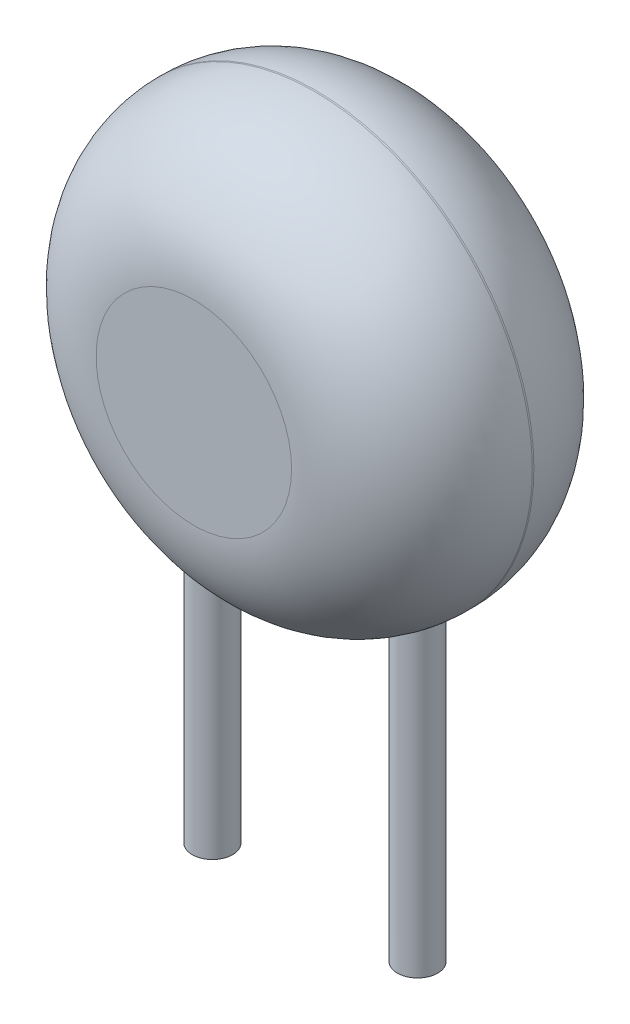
ISO-10303-21;
HEADER;
FILE_DESCRIPTION(('STEP AP214'),'2;1');
FILE_NAME('part.step','',(''),(''),'','','');
FILE_SCHEMA(('AUTOMOTIVE_DESIGN { 1 0 10303 214 1 1 1 1 }'));
ENDSEC;
DATA;
#1=APPLICATION_CONTEXT('core data for automotive mechanical design processes');
#2=APPLICATION_PROTOCOL_DEFINITION('international standard','automotive_design',2000,#1);
#3=PRODUCT_CONTEXT('',#1,'mechanical');
#4=PRODUCT('Part','Part','',(#3));
#5=PRODUCT_RELATED_PRODUCT_CATEGORY('part','',(#4));
#6=PRODUCT_DEFINITION_FORMATION('','',#4);
#7=PRODUCT_DEFINITION_CONTEXT('part definition',#1,'design');
#8=PRODUCT_DEFINITION('design','',#6,#7);
#9=PRODUCT_DEFINITION_SHAPE('','',#8);
#10=(LENGTH_UNIT() NAMED_UNIT(*) SI_UNIT(.MILLI.,.METRE.));
#11=(NAMED_UNIT(*) PLANE_ANGLE_UNIT() SI_UNIT($,.RADIAN.));
#12=(NAMED_UNIT(*) SI_UNIT($,.STERADIAN.) SOLID_ANGLE_UNIT());
#13=UNCERTAINTY_MEASURE_WITH_UNIT(LENGTH_MEASURE(1.E-05),#10,'distance_accuracy_value','');
#14=(GEOMETRIC_REPRESENTATION_CONTEXT(3) GLOBAL_UNCERTAINTY_ASSIGNED_CONTEXT((#13)) GLOBAL_UNIT_ASSIGNED_CONTEXT((#10,
#11,#12)) REPRESENTATION_CONTEXT('',''));
#15=CARTESIAN_POINT('',(0.,0.,0.));
#16=DIRECTION('',(0.,0.,1.));
#17=DIRECTION('',(1.,0.,0.));
#18=AXIS2_PLACEMENT_3D('',#15,#16,#17);
#19=CARTESIAN_POINT('',(0.,0.,3.));
#20=DIRECTION('',(0.,0.,-1.));
#21=DIRECTION('',(-1.,0.,0.));
#22=AXIS2_PLACEMENT_3D('',#19,#20,#21);
#23=CYLINDRICAL_SURFACE('',#22,2.7);
#24=CARTESIAN_POINT('',(0.,0.,1.51));
#25=DIRECTION('',(0.,0.,1.));
#26=DIRECTION('',(1.,0.,0.));
#27=AXIS2_PLACEMENT_3D('',#24,#25,#26);
#28=CIRCLE('',#27,2.7);
#29=CARTESIAN_POINT('',(1.02020008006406,-2.49983835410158,1.51));
#30=VERTEX_POINT('',#29);
#31=CARTESIAN_POINT('',(-1.02020008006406,-2.49983835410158,1.51));
#32=VERTEX_POINT('',#31);
#33=EDGE_CURVE('E88',#30,#32,#28,.F.);
#34=ORIENTED_EDGE('',*,*,#33,.T.);
#35=CARTESIAN_POINT('',(-1.27,-2.38266657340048,1.75));
#36=CARTESIAN_POINT('',(-1.25500944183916,-2.39065668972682,1.74999974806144));
#37=CARTESIAN_POINT('',(-1.23993911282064,-2.39850623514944,1.74865074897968));
#38=CARTESIAN_POINT('',(-1.21004988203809,-2.41372338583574,1.74318054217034));
#39=CARTESIAN_POINT('',(-1.19523102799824,-2.42109090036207,1.73905881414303));
#40=CARTESIAN_POINT('',(-1.16626288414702,-2.43517788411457,1.72799105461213));
#41=CARTESIAN_POINT('',(-1.15211663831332,-2.44189452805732,1.72103333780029));
#42=CARTESIAN_POINT('',(-1.12511800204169,-2.45445129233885,1.70435397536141));
#43=CARTESIAN_POINT('',(-1.112264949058,-2.46029186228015,1.69463375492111));
#44=CARTESIAN_POINT('',(-1.08947176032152,-2.47046432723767,1.67357794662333));
#45=CARTESIAN_POINT('',(-1.07937631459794,-2.47488267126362,1.66245251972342));
#46=CARTESIAN_POINT('',(-1.06122136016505,-2.48272174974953,1.63834273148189));
#47=CARTESIAN_POINT('',(-1.05316052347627,-2.486143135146,1.62535959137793));
#48=CARTESIAN_POINT('',(-1.04012618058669,-2.49162254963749,1.59924961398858));
#49=CARTESIAN_POINT('',(-1.03493243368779,-2.49377907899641,1.58625308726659));
#50=CARTESIAN_POINT('',(-1.02677195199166,-2.49715019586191,1.55946343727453));
#51=CARTESIAN_POINT('',(-1.02380430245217,-2.49836517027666,1.54567064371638));
#52=CARTESIAN_POINT('',(-1.02033795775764,-2.4997827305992,1.51856156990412));
#53=CARTESIAN_POINT('',(-1.01970361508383,-2.50004094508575,1.50526535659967));
#54=CARTESIAN_POINT('',(-1.02055185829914,-2.49969480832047,1.47875314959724));
#55=CARTESIAN_POINT('',(-1.02203410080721,-2.49909059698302,1.4655371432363));
#56=CARTESIAN_POINT('',(-1.02700868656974,-2.49705028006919,1.43979994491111));
#57=CARTESIAN_POINT('',(-1.03046531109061,-2.4956289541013,1.42727063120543));
#58=CARTESIAN_POINT('',(-1.03922462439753,-2.49199408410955,1.40299886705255));
#59=CARTESIAN_POINT('',(-1.04452738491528,-2.48978050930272,1.3912564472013));
#60=CARTESIAN_POINT('',(-1.05690931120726,-2.48454998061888,1.3686137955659));
#61=CARTESIAN_POINT('',(-1.06402335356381,-2.48151717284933,1.35773635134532));
#62=CARTESIAN_POINT('',(-1.07971138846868,-2.47473154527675,1.33734752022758));
#63=CARTESIAN_POINT('',(-1.08828566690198,-2.47097858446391,1.3278364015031));
#64=CARTESIAN_POINT('',(-1.10712682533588,-2.46259661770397,1.30986544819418));
#65=CARTESIAN_POINT('',(-1.11746162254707,-2.45793030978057,1.30149437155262));
#66=CARTESIAN_POINT('',(-1.13911021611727,-2.44797261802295,1.2865972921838));
#67=CARTESIAN_POINT('',(-1.15042433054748,-2.44268103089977,1.28007189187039));
#68=CARTESIAN_POINT('',(-1.17470219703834,-2.43110474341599,1.26845210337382));
#69=CARTESIAN_POINT('',(-1.18772445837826,-2.42477387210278,1.26352617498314));
#70=CARTESIAN_POINT('',(-1.21417733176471,-2.41163675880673,1.25592321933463));
#71=CARTESIAN_POINT('',(-1.2276081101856,-2.40483032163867,1.25324712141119));
#72=CARTESIAN_POINT('',(-1.25586994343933,-2.3902024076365,1.2499561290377));
#73=CARTESIAN_POINT('',(-1.27070975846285,-2.3823466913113,1.24956783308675));
#74=CARTESIAN_POINT('',(-1.30011748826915,-2.36642654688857,1.25138339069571));
#75=CARTESIAN_POINT('',(-1.3146852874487,-2.35836203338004,1.25358832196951));
#76=CARTESIAN_POINT('',(-1.34429169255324,-2.34162125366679,1.26077220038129));
#77=CARTESIAN_POINT('',(-1.35928284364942,-2.33294475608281,1.26594796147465));
#78=CARTESIAN_POINT('',(-1.38816748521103,-2.31587409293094,1.27911867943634));
#79=CARTESIAN_POINT('',(-1.40206023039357,-2.30748012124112,1.28711553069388));
#80=CARTESIAN_POINT('',(-1.42829479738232,-2.29133390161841,1.30582924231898));
#81=CARTESIAN_POINT('',(-1.44063786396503,-2.28358114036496,1.3165438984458));
#82=CARTESIAN_POINT('',(-1.46325974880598,-2.26915195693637,1.34055884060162));
#83=CARTESIAN_POINT('',(-1.47354267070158,-2.26247340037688,1.35385388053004));
#84=CARTESIAN_POINT('',(-1.48891293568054,-2.25237604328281,1.37865001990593));
#85=CARTESIAN_POINT('',(-1.49464718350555,-2.24856952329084,1.38959498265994));
#86=CARTESIAN_POINT('',(-1.50450852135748,-2.24198334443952,1.41247563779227));
#87=CARTESIAN_POINT('',(-1.50863690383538,-2.23920285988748,1.42441052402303));
#88=CARTESIAN_POINT('',(-1.51508478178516,-2.23484532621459,1.44904567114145));
#89=CARTESIAN_POINT('',(-1.5173945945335,-2.23327471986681,1.46174964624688));
#90=CARTESIAN_POINT('',(-1.5200186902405,-2.23148961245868,1.48745641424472));
#91=CARTESIAN_POINT('',(-1.52033366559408,-2.23127464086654,1.50045910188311));
#92=CARTESIAN_POINT('',(-1.51901189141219,-2.23217454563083,1.52514005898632));
#93=CARTESIAN_POINT('',(-1.51754767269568,-2.23317186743,1.53683251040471));
#94=CARTESIAN_POINT('',(-1.51303355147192,-2.23623272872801,1.55975973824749));
#95=CARTESIAN_POINT('',(-1.50998356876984,-2.23829632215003,1.5709944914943));
#96=CARTESIAN_POINT('',(-1.50238790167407,-2.24340180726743,1.59291166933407));
#97=CARTESIAN_POINT('',(-1.4978195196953,-2.24645852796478,1.60358267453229));
#98=CARTESIAN_POINT('',(-1.48739059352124,-2.25337708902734,1.62398699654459));
#99=CARTESIAN_POINT('',(-1.48152960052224,-2.25723920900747,1.63371998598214));
#100=CARTESIAN_POINT('',(-1.4679088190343,-2.26612390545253,1.65326802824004));
#101=CARTESIAN_POINT('',(-1.46000357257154,-2.27123105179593,1.66294293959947));
#102=CARTESIAN_POINT('',(-1.44304935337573,-2.28204070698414,1.68084852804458));
#103=CARTESIAN_POINT('',(-1.43399965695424,-2.28774359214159,1.68907828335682));
#104=CARTESIAN_POINT('',(-1.41342063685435,-2.30052415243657,1.70525233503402));
#105=CARTESIAN_POINT('',(-1.40172760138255,-2.30767437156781,1.71293128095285));
#106=CARTESIAN_POINT('',(-1.37738599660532,-2.32228541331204,1.72618679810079));
#107=CARTESIAN_POINT('',(-1.36473712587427,-2.32974633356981,1.73176270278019));
#108=CARTESIAN_POINT('',(-1.33863624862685,-2.34484160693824,1.74079327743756));
#109=CARTESIAN_POINT('',(-1.3251780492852,-2.35247691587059,1.74422844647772));
#110=CARTESIAN_POINT('',(-1.2978362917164,-2.3676709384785,1.74883201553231));
#111=CARTESIAN_POINT('',(-1.28395269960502,-2.37522964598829,1.75000023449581));
#112=CARTESIAN_POINT('',(-1.27,-2.38266657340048,1.75));
#113=B_SPLINE_CURVE_WITH_KNOTS('',3,(#35,#36,#37,#38,#39,#40,#41,#42,#43,#44,#45,#46,#47,#48,
#49,#50,#51,#52,#53,#54,#55,#56,#57,#58,#59,#60,#61,#62,#63,#64,#65,#66,#67,#68,#69,#70,#71,#72,
#73,#74,#75,#76,#77,#78,#79,#80,#81,#82,#83,#84,#85,#86,#87,#88,#89,#90,#91,#92,#93,#94,#95,#96,
#97,#98,#99,#100,#101,#102,#103,#104,#105,#106,#107,#108,#109,#110,#111,#112),.UNSPECIFIED.,.T.,
.F.,(4,2,2,2,2,2,2,2,2,2,2,2,2,2,2,2,2,2,2,2,2,2,2,2,2,2,2,2,2,2,2,2,2,2,2,2,2,2,4),(0.,
0.0509100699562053,0.101829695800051,0.152961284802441,0.204066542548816,0.250786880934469,
0.29747664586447,0.339740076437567,0.381986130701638,0.421733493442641,0.461474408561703,
0.500518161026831,0.539563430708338,0.579426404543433,0.619297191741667,0.661401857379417,
0.703520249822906,0.749213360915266,0.794925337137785,0.845097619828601,0.895290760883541,
0.949272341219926,1.0032902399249,1.05726446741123,1.11113008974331,1.14976081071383,
1.18836037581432,1.22716409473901,1.26595434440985,1.30126520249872,1.33657784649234,
1.37244406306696,1.40832275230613,1.44866058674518,1.48902405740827,1.5359690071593,
1.58292882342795,1.63031039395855,1.67769574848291),.UNSPECIFIED.);
#114=CARTESIAN_POINT('',(-1.02020008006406,-2.49983835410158,1.49));
#115=VERTEX_POINT('',#114);
#116=EDGE_CURVE('E54',#32,#115,#113,.T.);
#117=ORIENTED_EDGE('',*,*,#116,.T.);
#118=CARTESIAN_POINT('',(0.,0.,1.49));
#119=DIRECTION('',(0.,0.,1.));
#120=DIRECTION('',(1.,0.,0.));
#121=AXIS2_PLACEMENT_3D('',#118,#119,#120);
#122=CIRCLE('',#121,2.7);
#123=CARTESIAN_POINT('',(1.02020008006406,-2.49983835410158,1.49));
#124=VERTEX_POINT('',#123);
#125=EDGE_CURVE('E162',#115,#124,#122,.T.);
#126=ORIENTED_EDGE('',*,*,#125,.T.);
#127=CARTESIAN_POINT('',(1.27,-2.38266657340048,1.75));
#128=CARTESIAN_POINT('',(1.28883515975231,-2.37262653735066,1.74999924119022));
#129=CARTESIAN_POINT('',(1.30757625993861,-2.36234678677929,1.74786738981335));
#130=CARTESIAN_POINT('',(1.34413607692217,-2.34173885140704,1.73949321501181));
#131=CARTESIAN_POINT('',(1.36195238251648,-2.33141060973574,1.73324067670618));
#132=CARTESIAN_POINT('',(1.39342450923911,-2.31271540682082,1.71800271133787));
#133=CARTESIAN_POINT('',(1.40730572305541,-2.30428451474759,1.70955916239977));
#134=CARTESIAN_POINT('',(1.43340490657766,-2.28814002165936,1.68990688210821));
#135=CARTESIAN_POINT('',(1.44562663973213,-2.28042481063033,1.67870457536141));
#136=CARTESIAN_POINT('',(1.46531577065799,-2.26780815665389,1.65658123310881));
#137=CARTESIAN_POINT('',(1.4732294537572,-2.26266825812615,1.6461919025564));
#138=CARTESIAN_POINT('',(1.48748188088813,-2.25332425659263,1.62399687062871));
#139=CARTESIAN_POINT('',(1.49382125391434,-2.24911977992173,1.61219173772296));
#140=CARTESIAN_POINT('',(1.50465483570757,-2.24188691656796,1.58730684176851));
#141=CARTESIAN_POINT('',(1.50913517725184,-2.23886737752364,1.57421836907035));
#142=CARTESIAN_POINT('',(1.51588863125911,-2.23430051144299,1.54723905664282));
#143=CARTESIAN_POINT('',(1.51816384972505,-2.23275177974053,1.53334899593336));
#144=CARTESIAN_POINT('',(1.52019927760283,-2.23136622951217,1.50711583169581));
#145=CARTESIAN_POINT('',(1.52024618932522,-2.23133425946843,1.49480445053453));
#146=CARTESIAN_POINT('',(1.51853939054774,-2.23249618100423,1.47036818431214));
#147=CARTESIAN_POINT('',(1.51678605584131,-2.23368981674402,1.45824326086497));
#148=CARTESIAN_POINT('',(1.51170313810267,-2.23713261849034,1.43508622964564));
#149=CARTESIAN_POINT('',(1.50844949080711,-2.23933089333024,1.42402950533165));
#150=CARTESIAN_POINT('',(1.50055220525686,-2.24463039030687,1.40265745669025));
#151=CARTESIAN_POINT('',(1.49590825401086,-2.24773181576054,1.39234229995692));
#152=CARTESIAN_POINT('',(1.48496045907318,-2.25498091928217,1.37178551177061));
#153=CARTESIAN_POINT('',(1.47854884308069,-2.2591952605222,1.36162514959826));
#154=CARTESIAN_POINT('',(1.46452480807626,-2.26831150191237,1.34251739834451));
#155=CARTESIAN_POINT('',(1.45691177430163,-2.27321375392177,1.333570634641));
#156=CARTESIAN_POINT('',(1.43942665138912,-2.28433228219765,1.31567849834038));
#157=CARTESIAN_POINT('',(1.42938737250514,-2.29063433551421,1.30694988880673));
#158=CARTESIAN_POINT('',(1.40825413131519,-2.30368723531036,1.29129205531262));
#159=CARTESIAN_POINT('',(1.39715953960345,-2.31043834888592,1.28436391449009));
#160=CARTESIAN_POINT('',(1.37241864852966,-2.325232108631,1.27145408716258));
#161=CARTESIAN_POINT('',(1.3586397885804,-2.33331605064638,1.26577244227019));
#162=CARTESIAN_POINT('',(1.33033703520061,-2.34956806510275,1.25693738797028));
#163=CARTESIAN_POINT('',(1.31581276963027,-2.35773617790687,1.25378525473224));
#164=CARTESIAN_POINT('',(1.2852353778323,-2.37455186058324,1.24995435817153));
#165=CARTESIAN_POINT('',(1.26914989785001,-2.38318874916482,1.24948154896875));
#166=CARTESIAN_POINT('',(1.23696807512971,-2.40004997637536,1.25166776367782));
#167=CARTESIAN_POINT('',(1.2208717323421,-2.40827431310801,1.25432680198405));
#168=CARTESIAN_POINT('',(1.18962121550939,-2.42386020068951,1.26273623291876));
#169=CARTESIAN_POINT('',(1.17445339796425,-2.43123874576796,1.2684035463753));
#170=CARTESIAN_POINT('',(1.14519981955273,-2.44515428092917,1.28276764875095));
#171=CARTESIAN_POINT('',(1.13111337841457,-2.45169180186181,1.29146251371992));
#172=CARTESIAN_POINT('',(1.10591234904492,-2.46315484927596,1.31078252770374));
#173=CARTESIAN_POINT('',(1.09464290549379,-2.4681741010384,1.32114974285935));
#174=CARTESIAN_POINT('',(1.07402758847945,-2.47721448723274,1.34401537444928));
#175=CARTESIAN_POINT('',(1.06468032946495,-2.48123634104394,1.35651224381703));
#176=CARTESIAN_POINT('',(1.04920588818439,-2.4878164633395,1.38189741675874));
#177=CARTESIAN_POINT('',(1.04284849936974,-2.49048168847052,1.39461798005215));
#178=CARTESIAN_POINT('',(1.03235154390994,-2.494851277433,1.42109691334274));
#179=CARTESIAN_POINT('',(1.02821091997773,-2.49655609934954,1.43485478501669));
#180=CARTESIAN_POINT('',(1.02254580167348,-2.4988815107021,1.46198526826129));
#181=CARTESIAN_POINT('',(1.02086021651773,-2.49956891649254,1.475318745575));
#182=CARTESIAN_POINT('',(1.01965002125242,-2.50006286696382,1.50209857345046));
#183=CARTESIAN_POINT('',(1.02012494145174,-2.4998696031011,1.51554489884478));
#184=CARTESIAN_POINT('',(1.02317207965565,-2.49862389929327,1.54178118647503));
#185=CARTESIAN_POINT('',(1.02568662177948,-2.49759508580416,1.55457904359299));
#186=CARTESIAN_POINT('',(1.0326383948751,-2.49472883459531,1.57954481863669));
#187=CARTESIAN_POINT('',(1.03707562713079,-2.4928913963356,1.59171273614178));
#188=CARTESIAN_POINT('',(1.04776614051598,-2.48841714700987,1.61524380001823));
#189=CARTESIAN_POINT('',(1.05404062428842,-2.48577098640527,1.62659550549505));
#190=CARTESIAN_POINT('',(1.06815127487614,-2.47974022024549,1.64806135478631));
#191=CARTESIAN_POINT('',(1.07598762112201,-2.47635552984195,1.65817535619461));
#192=CARTESIAN_POINT('',(1.09336280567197,-2.46873485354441,1.67741257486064));
#193=CARTESIAN_POINT('',(1.10296517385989,-2.46446587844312,1.68646520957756));
#194=CARTESIAN_POINT('',(1.12327506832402,-2.45527541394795,1.70283520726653));
#195=CARTESIAN_POINT('',(1.13398319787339,-2.45035356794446,1.71015161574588));
#196=CARTESIAN_POINT('',(1.15707015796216,-2.43954166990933,1.72346873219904));
#197=CARTESIAN_POINT('',(1.16951413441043,-2.43360577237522,1.72931886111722));
#198=CARTESIAN_POINT('',(1.19494641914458,-2.42121928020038,1.73885408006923));
#199=CARTESIAN_POINT('',(1.20793430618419,-2.41476908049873,1.74254081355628));
#200=CARTESIAN_POINT('',(1.22914948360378,-2.40401222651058,1.74677901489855));
#201=CARTESIAN_POINT('',(1.23731086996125,-2.39982215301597,1.74798948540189));
#202=CARTESIAN_POINT('',(1.25365405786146,-2.39132528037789,1.74960026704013));
#203=CARTESIAN_POINT('',(1.26183586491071,-2.3870184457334,1.75000032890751));
#204=CARTESIAN_POINT('',(1.27,-2.38266657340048,1.75));
#205=B_SPLINE_CURVE_WITH_KNOTS('',3,(#127,#128,#129,#130,#131,#132,#133,#134,#135,#136,#137,
#138,#139,#140,#141,#142,#143,#144,#145,#146,#147,#148,#149,#150,#151,#152,#153,#154,#155,#156,
#157,#158,#159,#160,#161,#162,#163,#164,#165,#166,#167,#168,#169,#170,#171,#172,#173,#174,#175,
#176,#177,#178,#179,#180,#181,#182,#183,#184,#185,#186,#187,#188,#189,#190,#191,#192,#193,#194,
#195,#196,#197,#198,#199,#200,#201,#202,#203,#204),.UNSPECIFIED.,.T.,.F.,(4,2,2,2,2,2,2,2,2,2,2,
2,2,2,2,2,2,2,2,2,2,2,2,2,2,2,2,2,2,2,2,2,2,2,2,2,2,2,4),(0.,0.06398654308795,0.12813230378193,
0.182778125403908,0.237297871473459,0.279235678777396,0.321156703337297,0.363385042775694,
0.405573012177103,0.442315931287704,0.479051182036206,0.514102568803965,0.5491618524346,
0.587210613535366,0.62527890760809,0.669269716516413,0.713286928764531,0.763938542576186,
0.814615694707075,0.869140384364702,0.923665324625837,0.976757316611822,1.02981563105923,
1.07789153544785,1.1259326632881,1.16910970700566,1.21226613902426,1.25243862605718,
1.29260238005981,1.33166842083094,1.37073448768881,1.4102704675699,1.44981099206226,
1.49124385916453,1.53269945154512,1.57744640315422,1.62215931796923,1.64988587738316,
1.67762096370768),.UNSPECIFIED.);
#206=EDGE_CURVE('E133',#124,#30,#205,.T.);
#207=ORIENTED_EDGE('',*,*,#206,.T.);
#208=EDGE_LOOP('',(#34,#117,#126,#207));
#209=FACE_BOUND('',#208,.T.);
#210=ADVANCED_FACE('F33',(#209),#23,.T.);
#211=CARTESIAN_POINT('',(1.51979991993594,-2.23163800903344,1.49));
#212=VERTEX_POINT('',#211);
#213=CARTESIAN_POINT('',(-1.51979991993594,-2.23163800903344,1.49));
#214=VERTEX_POINT('',#213);
#215=EDGE_CURVE('E93',#212,#214,#122,.T.);
#216=ORIENTED_EDGE('',*,*,#215,.T.);
#217=CARTESIAN_POINT('',(-1.51979991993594,-2.23163800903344,1.51));
#218=VERTEX_POINT('',#217);
#219=EDGE_CURVE('E92',#214,#218,#113,.T.);
#220=ORIENTED_EDGE('',*,*,#219,.T.);
#221=CARTESIAN_POINT('',(1.51979991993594,-2.23163800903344,1.51));
#222=VERTEX_POINT('',#221);
#223=EDGE_CURVE('E81',#218,#222,#28,.F.);
#224=ORIENTED_EDGE('',*,*,#223,.T.);
#225=EDGE_CURVE('E137',#222,#212,#205,.T.);
#226=ORIENTED_EDGE('',*,*,#225,.T.);
#227=EDGE_LOOP('',(#216,#220,#224,#226));
#228=FACE_BOUND('',#227,.T.);
#229=ADVANCED_FACE('F35',(#228),#23,.T.);
#230=CARTESIAN_POINT('',(0.,0.,3.));
#231=DIRECTION('',(0.,0.,1.));
#232=DIRECTION('',(1.,0.,0.));
#233=AXIS2_PLACEMENT_3D('',#230,#231,#232);
#234=PLANE('',#233);
#235=CARTESIAN_POINT('',(0.,0.,3.));
#236=DIRECTION('',(0.,0.,1.));
#237=DIRECTION('',(1.,0.,0.));
#238=AXIS2_PLACEMENT_3D('',#235,#236,#237);
#239=CIRCLE('',#238,1.21);
#240=CARTESIAN_POINT('',(1.21,0.,3.));
#241=VERTEX_POINT('',#240);
#242=EDGE_CURVE('E167',#241,#241,#239,.T.);
#243=ORIENTED_EDGE('',*,*,#242,.T.);
#244=EDGE_LOOP('',(#243));
#245=FACE_BOUND('',#244,.T.);
#246=ADVANCED_FACE('F150',(#245),#234,.T.);
#247=CARTESIAN_POINT('',(0.,0.,0.));
#248=DIRECTION('',(0.,0.,1.));
#249=DIRECTION('',(1.,0.,0.));
#250=AXIS2_PLACEMENT_3D('',#247,#248,#249);
#251=PLANE('',#250);
#252=CARTESIAN_POINT('',(0.,0.,0.));
#253=DIRECTION('',(0.,0.,1.));
#254=DIRECTION('',(1.,0.,0.));
#255=AXIS2_PLACEMENT_3D('',#252,#253,#254);
#256=CIRCLE('',#255,1.21);
#257=CARTESIAN_POINT('',(1.21,0.,0.));
#258=VERTEX_POINT('',#257);
#259=EDGE_CURVE('E164',#258,#258,#256,.F.);
#260=ORIENTED_EDGE('',*,*,#259,.T.);
#261=EDGE_LOOP('',(#260));
#262=FACE_BOUND('',#261,.T.);
#263=ADVANCED_FACE('F147',(#262),#251,.F.);
#264=CARTESIAN_POINT('',(0.,0.,1.49));
#265=DIRECTION('',(0.,0.,1.));
#266=DIRECTION('',(1.,0.,0.));
#267=AXIS2_PLACEMENT_3D('',#264,#265,#266);
#268=DEGENERATE_TOROIDAL_SURFACE('',#267,1.21,1.49,.T.);
#269=CARTESIAN_POINT('',(-1.5198078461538,-2.23163259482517,1.4902));
#270=CARTESIAN_POINT('',(-1.51930724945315,-2.23198023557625,1.47704435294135));
#271=CARTESIAN_POINT('',(-1.51773879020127,-2.23283512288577,1.46395739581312));
#272=CARTESIAN_POINT('',(-1.51261921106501,-2.23549612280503,1.43832337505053));
#273=CARTESIAN_POINT('',(-1.50907505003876,-2.23729889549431,1.42577458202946));
#274=CARTESIAN_POINT('',(-1.50015446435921,-2.24179421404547,1.40153013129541));
#275=CARTESIAN_POINT('',(-1.49477922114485,-2.24448618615,1.38983392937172));
#276=CARTESIAN_POINT('',(-1.48241682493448,-2.25067225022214,1.36755605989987));
#277=CARTESIAN_POINT('',(-1.4754287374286,-2.25416680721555,1.35697504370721));
#278=CARTESIAN_POINT('',(-1.45976137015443,-2.26202229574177,1.33671616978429));
#279=CARTESIAN_POINT('',(-1.45102234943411,-2.26641398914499,1.32709661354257));
#280=CARTESIAN_POINT('',(-1.43235712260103,-2.27583904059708,1.30946076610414));
#281=CARTESIAN_POINT('',(-1.42243051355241,-2.28087261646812,1.3014450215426));
#282=CARTESIAN_POINT('',(-1.40066015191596,-2.29197795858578,1.28641279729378));
#283=CARTESIAN_POINT('',(-1.3887238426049,-2.29810309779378,1.27956993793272));
#284=CARTESIAN_POINT('',(-1.36410815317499,-2.31082736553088,1.2679894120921));
#285=CARTESIAN_POINT('',(-1.35142846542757,-2.31742669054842,1.26325262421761));
#286=CARTESIAN_POINT('',(-1.32428298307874,-2.33166252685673,1.2555152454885));
#287=CARTESIAN_POINT('',(-1.3097692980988,-2.33933524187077,1.25274873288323));
#288=CARTESIAN_POINT('',(-1.28059066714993,-2.35488883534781,1.24979385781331));
#289=CARTESIAN_POINT('',(-1.26592566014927,-2.36276979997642,1.24960657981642));
#290=CARTESIAN_POINT('',(-1.23568301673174,-2.37914959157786,1.25186826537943));
#291=CARTESIAN_POINT('',(-1.22012080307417,-2.38764982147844,1.25451882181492));
#292=CARTESIAN_POINT('',(-1.18964628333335,-2.40442083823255,1.26273964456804));
#293=CARTESIAN_POINT('',(-1.17473423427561,-2.41269153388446,1.26831105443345));
#294=CARTESIAN_POINT('',(-1.14596044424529,-2.42875117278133,1.28235034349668));
#295=CARTESIAN_POINT('',(-1.1321028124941,-2.43653821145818,1.29082890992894));
#296=CARTESIAN_POINT('',(-1.10601795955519,-2.45126543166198,1.31058743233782));
#297=CARTESIAN_POINT('',(-1.09378992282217,-2.45820603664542,1.32186597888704));
#298=CARTESIAN_POINT('',(-1.07256940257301,-2.47028117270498,1.34587663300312));
#299=CARTESIAN_POINT('',(-1.06338379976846,-2.47552255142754,1.35838326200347));
#300=CARTESIAN_POINT('',(-1.0473533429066,-2.48466511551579,1.38523147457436));
#301=CARTESIAN_POINT('',(-1.04050272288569,-2.48856960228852,1.39956841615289));
#302=CARTESIAN_POINT('',(-1.03070217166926,-2.49412002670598,1.4265295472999));
#303=CARTESIAN_POINT('',(-1.02724203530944,-2.4960639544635,1.4389081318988));
#304=CARTESIAN_POINT('',(-1.02222964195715,-2.49882945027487,1.46423119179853));
#305=CARTESIAN_POINT('',(-1.02068732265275,-2.49964517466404,1.47717825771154));
#306=CARTESIAN_POINT('',(-1.0201921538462,-2.49984157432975,1.4902));
#307=B_SPLINE_CURVE_WITH_KNOTS('',3,(#269,#270,#271,#272,#273,#274,#275,#276,#277,#278,#279,
#280,#281,#282,#283,#284,#285,#286,#287,#288,#289,#290,#291,#292,#293,#294,#295,#296,#297,#298,
#299,#300,#301,#302,#303,#304,#305,#306),.UNSPECIFIED.,.F.,.F.,(4,2,2,2,2,2,2,2,2,2,2,2,2,2,2,2,
2,2,4),(0.,0.0394373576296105,0.0787366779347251,0.118010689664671,0.157307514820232,
0.198291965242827,0.239290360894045,0.284285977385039,0.329300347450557,0.379033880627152,
0.428788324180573,0.48232703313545,0.535886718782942,0.589645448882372,0.643377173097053,
0.692222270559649,0.740945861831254,0.779749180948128,0.818752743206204),.UNSPECIFIED.);
#308=EDGE_CURVE('E61',#214,#115,#307,.T.);
#309=ORIENTED_EDGE('',*,*,#308,.F.);
#310=ORIENTED_EDGE('',*,*,#215,.F.);
#311=CARTESIAN_POINT('',(1.0201921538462,-2.49984157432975,1.4902));
#312=CARTESIAN_POINT('',(1.02067722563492,-2.49964933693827,1.47741629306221));
#313=CARTESIAN_POINT('',(1.02217399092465,-2.49885884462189,1.46469929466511));
#314=CARTESIAN_POINT('',(1.0270299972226,-2.49618213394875,1.43980567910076));
#315=CARTESIAN_POINT('',(1.03038038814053,-2.49430112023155,1.42762678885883));
#316=CARTESIAN_POINT('',(1.03878519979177,-2.48954334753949,1.40410272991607));
#317=CARTESIAN_POINT('',(1.04383759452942,-2.48666777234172,1.39275658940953));
#318=CARTESIAN_POINT('',(1.05543073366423,-2.48005944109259,1.37111718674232));
#319=CARTESIAN_POINT('',(1.0619729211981,-2.47632585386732,1.36082495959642));
#320=CARTESIAN_POINT('',(1.07674684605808,-2.46790386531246,1.34088874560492));
#321=CARTESIAN_POINT('',(1.08505689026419,-2.46317134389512,1.33132172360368));
#322=CARTESIAN_POINT('',(1.10281952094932,-2.45308472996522,1.31370084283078));
#323=CARTESIAN_POINT('',(1.11227250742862,-2.44773041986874,1.30564751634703));
#324=CARTESIAN_POINT('',(1.13340220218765,-2.43581033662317,1.29015537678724));
#325=CARTESIAN_POINT('',(1.1452072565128,-2.42917829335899,1.28294256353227));
#326=CARTESIAN_POINT('',(1.16965433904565,-2.41552150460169,1.2706129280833));
#327=CARTESIAN_POINT('',(1.18229680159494,-2.40849655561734,1.26549720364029));
#328=CARTESIAN_POINT('',(1.20967494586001,-2.39338170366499,1.25691488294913));
#329=CARTESIAN_POINT('',(1.22448051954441,-2.38526466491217,1.25371751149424));
#330=CARTESIAN_POINT('',(1.25440609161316,-2.36898843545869,1.25003138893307));
#331=CARTESIAN_POINT('',(1.26952621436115,-2.36082922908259,1.24954373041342));
#332=CARTESIAN_POINT('',(1.3005475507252,-2.34422870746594,1.25136081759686));
#333=CARTESIAN_POINT('',(1.31644517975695,-2.33579711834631,1.25382318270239));
#334=CARTESIAN_POINT('',(1.34769019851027,-2.31937120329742,1.26183147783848));
#335=CARTESIAN_POINT('',(1.36303754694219,-2.31137691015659,1.26737763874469));
#336=CARTESIAN_POINT('',(1.39215438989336,-2.29633391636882,1.28129906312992));
#337=CARTESIAN_POINT('',(1.40595905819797,-2.28926285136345,1.28957594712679));
#338=CARTESIAN_POINT('',(1.4319831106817,-2.27602059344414,1.30888891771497));
#339=CARTESIAN_POINT('',(1.44420373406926,-2.26984869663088,1.31992282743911));
#340=CARTESIAN_POINT('',(1.46534741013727,-2.25921519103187,1.34327654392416));
#341=CARTESIAN_POINT('',(1.47447771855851,-2.25464443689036,1.35535862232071));
#342=CARTESIAN_POINT('',(1.4905149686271,-2.24661993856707,1.381238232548));
#343=CARTESIAN_POINT('',(1.49742500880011,-2.24316463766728,1.39503333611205));
#344=CARTESIAN_POINT('',(1.50796939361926,-2.23785918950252,1.42217839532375));
#345=CARTESIAN_POINT('',(1.51189454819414,-2.23586750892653,1.43538795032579));
#346=CARTESIAN_POINT('',(1.51755418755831,-2.23293574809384,1.46243593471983));
#347=CARTESIAN_POINT('',(1.51927952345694,-2.23200006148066,1.47627674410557));
#348=CARTESIAN_POINT('',(1.5198078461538,-2.23163259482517,1.4902));
#349=B_SPLINE_CURVE_WITH_KNOTS('',3,(#311,#312,#313,#314,#315,#316,#317,#318,#319,#320,#321,
#322,#323,#324,#325,#326,#327,#328,#329,#330,#331,#332,#333,#334,#335,#336,#337,#338,#339,#340,
#341,#342,#343,#344,#345,#346,#347,#348),.UNSPECIFIED.,.F.,.F.,(4,2,2,2,2,2,2,2,2,2,2,2,2,2,2,2,
2,2,4),(0.,0.0383034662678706,0.0764256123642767,0.114502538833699,0.152616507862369,
0.193037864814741,0.233473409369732,0.279313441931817,0.325177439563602,0.376507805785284,
0.427858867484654,0.482080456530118,0.536306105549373,0.588759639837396,0.641171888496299,
0.688360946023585,0.735483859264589,0.777032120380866,0.818752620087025),.UNSPECIFIED.);
#350=EDGE_CURVE('E89',#124,#212,#349,.T.);
#351=ORIENTED_EDGE('',*,*,#350,.F.);
#352=ORIENTED_EDGE('',*,*,#125,.F.);
#353=EDGE_LOOP('',(#309,#310,#351,#352));
#354=FACE_BOUND('',#353,.T.);
#355=ORIENTED_EDGE('',*,*,#259,.F.);
#356=EDGE_LOOP('',(#355));
#357=FACE_BOUND('',#356,.T.);
#358=ADVANCED_FACE('F143',(#354,#357),#268,.T.);
#359=CARTESIAN_POINT('',(0.,0.,1.51));
#360=DIRECTION('',(0.,0.,1.));
#361=DIRECTION('',(1.,0.,0.));
#362=AXIS2_PLACEMENT_3D('',#359,#360,#361);
#363=DEGENERATE_TOROIDAL_SURFACE('',#362,1.21,1.49,.T.);
#364=CARTESIAN_POINT('',(-1.0201921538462,-2.49984157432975,1.5098));
#365=CARTESIAN_POINT('',(-1.02067722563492,-2.49964933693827,1.52258370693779));
#366=CARTESIAN_POINT('',(-1.02217399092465,-2.49885884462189,1.53530070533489));
#367=CARTESIAN_POINT('',(-1.0270299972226,-2.49618213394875,1.56019432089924));
#368=CARTESIAN_POINT('',(-1.03038038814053,-2.49430112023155,1.57237321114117));
#369=CARTESIAN_POINT('',(-1.03878519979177,-2.48954334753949,1.59589727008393));
#370=CARTESIAN_POINT('',(-1.04383759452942,-2.48666777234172,1.60724341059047));
#371=CARTESIAN_POINT('',(-1.05543073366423,-2.48005944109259,1.62888281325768));
#372=CARTESIAN_POINT('',(-1.0619729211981,-2.47632585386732,1.63917504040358));
#373=CARTESIAN_POINT('',(-1.07674684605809,-2.46790386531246,1.65911125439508));
#374=CARTESIAN_POINT('',(-1.08505689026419,-2.46317134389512,1.66867827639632));
#375=CARTESIAN_POINT('',(-1.10281952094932,-2.45308472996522,1.68629915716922));
#376=CARTESIAN_POINT('',(-1.11227250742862,-2.44773041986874,1.69435248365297));
#377=CARTESIAN_POINT('',(-1.13340220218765,-2.43581033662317,1.70984462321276));
#378=CARTESIAN_POINT('',(-1.1452072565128,-2.42917829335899,1.71705743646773));
#379=CARTESIAN_POINT('',(-1.16965433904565,-2.41552150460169,1.72938707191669));
#380=CARTESIAN_POINT('',(-1.18229680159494,-2.40849655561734,1.73450279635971));
#381=CARTESIAN_POINT('',(-1.20967494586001,-2.39338170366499,1.74308511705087));
#382=CARTESIAN_POINT('',(-1.22448051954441,-2.38526466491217,1.74628248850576));
#383=CARTESIAN_POINT('',(-1.25440609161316,-2.36898843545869,1.74996861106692));
#384=CARTESIAN_POINT('',(-1.26952621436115,-2.36082922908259,1.75045626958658));
#385=CARTESIAN_POINT('',(-1.3005475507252,-2.34422870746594,1.74863918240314));
#386=CARTESIAN_POINT('',(-1.31644517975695,-2.33579711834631,1.74617681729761));
#387=CARTESIAN_POINT('',(-1.34769019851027,-2.31937120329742,1.73816852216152));
#388=CARTESIAN_POINT('',(-1.36303754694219,-2.31137691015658,1.73262236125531));
#389=CARTESIAN_POINT('',(-1.39215438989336,-2.29633391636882,1.71870093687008));
#390=CARTESIAN_POINT('',(-1.40595905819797,-2.28926285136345,1.71042405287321));
#391=CARTESIAN_POINT('',(-1.4319831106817,-2.27602059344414,1.69111108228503));
#392=CARTESIAN_POINT('',(-1.44420373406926,-2.26984869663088,1.68007717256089));
#393=CARTESIAN_POINT('',(-1.46534741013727,-2.25921519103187,1.65672345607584));
#394=CARTESIAN_POINT('',(-1.47447771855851,-2.25464443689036,1.64464137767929));
#395=CARTESIAN_POINT('',(-1.4905149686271,-2.24661993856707,1.618761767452));
#396=CARTESIAN_POINT('',(-1.49742500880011,-2.24316463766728,1.60496666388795));
#397=CARTESIAN_POINT('',(-1.50796939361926,-2.23785918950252,1.57782160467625));
#398=CARTESIAN_POINT('',(-1.51189454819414,-2.23586750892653,1.56461204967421));
#399=CARTESIAN_POINT('',(-1.51755418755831,-2.23293574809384,1.53756406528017));
#400=CARTESIAN_POINT('',(-1.51927952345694,-2.23200006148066,1.52372325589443));
#401=CARTESIAN_POINT('',(-1.5198078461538,-2.23163259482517,1.5098));
#402=B_SPLINE_CURVE_WITH_KNOTS('',3,(#364,#365,#366,#367,#368,#369,#370,#371,#372,#373,#374,
#375,#376,#377,#378,#379,#380,#381,#382,#383,#384,#385,#386,#387,#388,#389,#390,#391,#392,#393,
#394,#395,#396,#397,#398,#399,#400,#401),.UNSPECIFIED.,.F.,.F.,(4,2,2,2,2,2,2,2,2,2,2,2,2,2,2,2,
2,2,4),(0.,0.0383034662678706,0.0764256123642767,0.1145025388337,0.152616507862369,
0.193037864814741,0.233473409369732,0.279313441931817,0.325177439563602,0.376507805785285,
0.427858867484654,0.482080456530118,0.536306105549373,0.588759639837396,0.641171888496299,
0.688360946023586,0.735483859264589,0.777032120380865,0.818752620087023),.UNSPECIFIED.);
#403=EDGE_CURVE('E11',#32,#218,#402,.T.);
#404=ORIENTED_EDGE('',*,*,#403,.F.);
#405=ORIENTED_EDGE('',*,*,#33,.F.);
#406=CARTESIAN_POINT('',(1.5198078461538,-2.23163259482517,1.5098));
#407=CARTESIAN_POINT('',(1.51930724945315,-2.23198023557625,1.52295564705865));
#408=CARTESIAN_POINT('',(1.51773879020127,-2.23283512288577,1.53604260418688));
#409=CARTESIAN_POINT('',(1.51261921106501,-2.23549612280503,1.56167662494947));
#410=CARTESIAN_POINT('',(1.50907505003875,-2.23729889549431,1.57422541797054));
#411=CARTESIAN_POINT('',(1.50015446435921,-2.24179421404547,1.59846986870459));
#412=CARTESIAN_POINT('',(1.49477922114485,-2.24448618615,1.61016607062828));
#413=CARTESIAN_POINT('',(1.48241682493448,-2.25067225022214,1.63244394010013));
#414=CARTESIAN_POINT('',(1.4754287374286,-2.25416680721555,1.64302495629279));
#415=CARTESIAN_POINT('',(1.45976137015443,-2.26202229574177,1.66328383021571));
#416=CARTESIAN_POINT('',(1.45102234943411,-2.26641398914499,1.67290338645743));
#417=CARTESIAN_POINT('',(1.43235712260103,-2.27583904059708,1.69053923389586));
#418=CARTESIAN_POINT('',(1.42243051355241,-2.28087261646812,1.6985549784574));
#419=CARTESIAN_POINT('',(1.40066015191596,-2.29197795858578,1.71358720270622));
#420=CARTESIAN_POINT('',(1.3887238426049,-2.29810309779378,1.72043006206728));
#421=CARTESIAN_POINT('',(1.36410815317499,-2.31082736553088,1.7320105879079));
#422=CARTESIAN_POINT('',(1.35142846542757,-2.31742669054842,1.73674737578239));
#423=CARTESIAN_POINT('',(1.32428298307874,-2.33166252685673,1.7444847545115));
#424=CARTESIAN_POINT('',(1.3097692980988,-2.33933524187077,1.74725126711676));
#425=CARTESIAN_POINT('',(1.28059066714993,-2.35488883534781,1.75020614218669));
#426=CARTESIAN_POINT('',(1.26592566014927,-2.36276979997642,1.75039342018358));
#427=CARTESIAN_POINT('',(1.23568301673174,-2.37914959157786,1.74813173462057));
#428=CARTESIAN_POINT('',(1.22012080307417,-2.38764982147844,1.74548117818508));
#429=CARTESIAN_POINT('',(1.18964628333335,-2.40442083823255,1.73726035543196));
#430=CARTESIAN_POINT('',(1.17473423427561,-2.41269153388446,1.73168894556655));
#431=CARTESIAN_POINT('',(1.14596044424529,-2.42875117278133,1.71764965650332));
#432=CARTESIAN_POINT('',(1.1321028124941,-2.43653821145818,1.70917109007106));
#433=CARTESIAN_POINT('',(1.10601795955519,-2.45126543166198,1.68941256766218));
#434=CARTESIAN_POINT('',(1.09378992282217,-2.45820603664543,1.67813402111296));
#435=CARTESIAN_POINT('',(1.07256940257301,-2.47028117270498,1.65412336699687));
#436=CARTESIAN_POINT('',(1.06338379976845,-2.47552255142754,1.64161673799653));
#437=CARTESIAN_POINT('',(1.0473533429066,-2.48466511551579,1.61476852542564));
#438=CARTESIAN_POINT('',(1.04050272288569,-2.48856960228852,1.6004315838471));
#439=CARTESIAN_POINT('',(1.03070217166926,-2.49412002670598,1.5734704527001));
#440=CARTESIAN_POINT('',(1.02724203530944,-2.4960639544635,1.5610918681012));
#441=CARTESIAN_POINT('',(1.02222964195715,-2.49882945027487,1.53576880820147));
#442=CARTESIAN_POINT('',(1.02068732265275,-2.49964517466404,1.52282174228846));
#443=CARTESIAN_POINT('',(1.0201921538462,-2.49984157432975,1.5098));
#444=B_SPLINE_CURVE_WITH_KNOTS('',3,(#406,#407,#408,#409,#410,#411,#412,#413,#414,#415,#416,
#417,#418,#419,#420,#421,#422,#423,#424,#425,#426,#427,#428,#429,#430,#431,#432,#433,#434,#435,
#436,#437,#438,#439,#440,#441,#442,#443),.UNSPECIFIED.,.F.,.F.,(4,2,2,2,2,2,2,2,2,2,2,2,2,2,2,2,
2,2,4),(0.,0.0394373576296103,0.078736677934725,0.118010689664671,0.157307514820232,
0.198291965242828,0.239290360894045,0.284285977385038,0.329300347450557,0.379033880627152,
0.428788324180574,0.48232703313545,0.535886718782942,0.589645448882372,0.643377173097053,
0.692222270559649,0.740945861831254,0.779749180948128,0.818752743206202),.UNSPECIFIED.);
#445=EDGE_CURVE('E47',#222,#30,#444,.T.);
#446=ORIENTED_EDGE('',*,*,#445,.F.);
#447=ORIENTED_EDGE('',*,*,#223,.F.);
#448=EDGE_LOOP('',(#404,#405,#446,#447));
#449=FACE_BOUND('',#448,.T.);
#450=ORIENTED_EDGE('',*,*,#242,.F.);
#451=EDGE_LOOP('',(#450));
#452=FACE_BOUND('',#451,.T.);
#453=ADVANCED_FACE('F83',(#449,#452),#363,.T.);
#454=CARTESIAN_POINT('',(1.27,-6.,1.5));
#455=DIRECTION('',(0.,1.,0.));
#456=DIRECTION('',(0.,0.,1.));
#457=AXIS2_PLACEMENT_3D('',#454,#455,#456);
#458=CYLINDRICAL_SURFACE('',#457,0.25);
#459=ORIENTED_EDGE('',*,*,#206,.F.);
#460=ORIENTED_EDGE('',*,*,#350,.T.);
#461=ORIENTED_EDGE('',*,*,#225,.F.);
#462=ORIENTED_EDGE('',*,*,#445,.T.);
#463=EDGE_LOOP('',(#459,#460,#461,#462));
#464=FACE_BOUND('',#463,.T.);
#465=CARTESIAN_POINT('',(1.27,-6.,1.5));
#466=DIRECTION('',(0.,1.,0.));
#467=DIRECTION('',(0.,0.,1.));
#468=AXIS2_PLACEMENT_3D('',#465,#466,#467);
#469=CIRCLE('',#468,0.25);
#470=CARTESIAN_POINT('',(1.27,-6.,1.75));
#471=VERTEX_POINT('',#470);
#472=EDGE_CURVE('E99',#471,#471,#469,.T.);
#473=ORIENTED_EDGE('',*,*,#472,.T.);
#474=EDGE_LOOP('',(#473));
#475=FACE_BOUND('',#474,.T.);
#476=ADVANCED_FACE('F119',(#464,#475),#458,.T.);
#477=CARTESIAN_POINT('',(1.27,-6.,1.5));
#478=DIRECTION('',(0.,1.,0.));
#479=DIRECTION('',(0.,0.,1.));
#480=AXIS2_PLACEMENT_3D('',#477,#478,#479);
#481=PLANE('',#480);
#482=ORIENTED_EDGE('',*,*,#472,.F.);
#483=EDGE_LOOP('',(#482));
#484=FACE_BOUND('',#483,.T.);
#485=ADVANCED_FACE('F114',(#484),#481,.F.);
#486=CARTESIAN_POINT('',(-1.27,-6.,1.5));
#487=DIRECTION('',(0.,1.,0.));
#488=DIRECTION('',(0.,0.,1.));
#489=AXIS2_PLACEMENT_3D('',#486,#487,#488);
#490=CYLINDRICAL_SURFACE('',#489,0.25);
#491=ORIENTED_EDGE('',*,*,#219,.F.);
#492=ORIENTED_EDGE('',*,*,#308,.T.);
#493=ORIENTED_EDGE('',*,*,#116,.F.);
#494=ORIENTED_EDGE('',*,*,#403,.T.);
#495=EDGE_LOOP('',(#491,#492,#493,#494));
#496=FACE_BOUND('',#495,.T.);
#497=CARTESIAN_POINT('',(-1.27,-6.,1.5));
#498=DIRECTION('',(0.,1.,0.));
#499=DIRECTION('',(0.,0.,1.));
#500=AXIS2_PLACEMENT_3D('',#497,#498,#499);
#501=CIRCLE('',#500,0.25);
#502=CARTESIAN_POINT('',(-1.27,-6.,1.75));
#503=VERTEX_POINT('',#502);
#504=EDGE_CURVE('E95',#503,#503,#501,.T.);
#505=ORIENTED_EDGE('',*,*,#504,.T.);
#506=EDGE_LOOP('',(#505));
#507=FACE_BOUND('',#506,.T.);
#508=ADVANCED_FACE('F97',(#496,#507),#490,.T.);
#509=CARTESIAN_POINT('',(-1.27,-6.,1.5));
#510=DIRECTION('',(0.,1.,0.));
#511=DIRECTION('',(0.,0.,1.));
#512=AXIS2_PLACEMENT_3D('',#509,#510,#511);
#513=PLANE('',#512);
#514=ORIENTED_EDGE('',*,*,#504,.F.);
#515=EDGE_LOOP('',(#514));
#516=FACE_BOUND('',#515,.T.);
#517=ADVANCED_FACE('F113',(#516),#513,.F.);
#518=CLOSED_SHELL('',(#210,#229,#246,#263,#358,#453,#476,#485,#508,#517));
#519=MANIFOLD_SOLID_BREP('B2',#518);
#520=ADVANCED_BREP_SHAPE_REPRESENTATION('',(#18,#519),#14);
#521=SHAPE_DEFINITION_REPRESENTATION(#9,#520);
ENDSEC;
END-ISO-10303-21;
